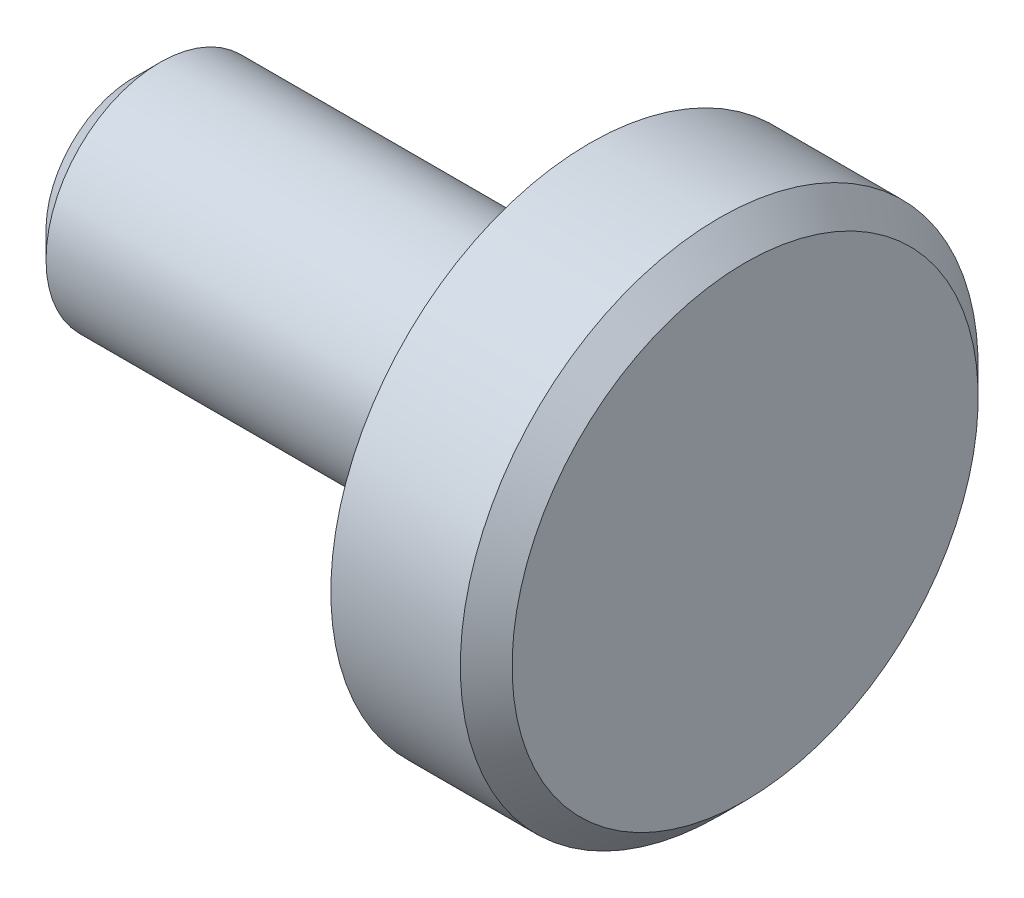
ISO-10303-21;
HEADER;
FILE_DESCRIPTION(('STEP AP214'),'2;1');
FILE_NAME('part.step','',(''),(''),'','','');
FILE_SCHEMA(('AUTOMOTIVE_DESIGN { 1 0 10303 214 1 1 1 1 }'));
ENDSEC;
DATA;
#1=APPLICATION_CONTEXT('core data for automotive mechanical design processes');
#2=APPLICATION_PROTOCOL_DEFINITION('international standard','automotive_design',2000,#1);
#3=PRODUCT_CONTEXT('',#1,'mechanical');
#4=PRODUCT('Part','Part','',(#3));
#5=PRODUCT_RELATED_PRODUCT_CATEGORY('part','',(#4));
#6=PRODUCT_DEFINITION_FORMATION('','',#4);
#7=PRODUCT_DEFINITION_CONTEXT('part definition',#1,'design');
#8=PRODUCT_DEFINITION('design','',#6,#7);
#9=PRODUCT_DEFINITION_SHAPE('','',#8);
#10=(LENGTH_UNIT() NAMED_UNIT(*) SI_UNIT(.MILLI.,.METRE.));
#11=(NAMED_UNIT(*) PLANE_ANGLE_UNIT() SI_UNIT($,.RADIAN.));
#12=(NAMED_UNIT(*) SI_UNIT($,.STERADIAN.) SOLID_ANGLE_UNIT());
#13=UNCERTAINTY_MEASURE_WITH_UNIT(LENGTH_MEASURE(1.E-05),#10,'distance_accuracy_value','');
#14=(GEOMETRIC_REPRESENTATION_CONTEXT(3) GLOBAL_UNCERTAINTY_ASSIGNED_CONTEXT((#13)) GLOBAL_UNIT_ASSIGNED_CONTEXT((#10,
#11,#12)) REPRESENTATION_CONTEXT('',''));
#15=CARTESIAN_POINT('',(0.,0.,0.));
#16=DIRECTION('',(0.,0.,1.));
#17=DIRECTION('',(1.,0.,0.));
#18=AXIS2_PLACEMENT_3D('',#15,#16,#17);
#19=CARTESIAN_POINT('',(0.,6.35,0.));
#20=DIRECTION('',(1.,0.,0.));
#21=DIRECTION('',(0.,1.,0.));
#22=AXIS2_PLACEMENT_3D('',#19,#20,#21);
#23=PLANE('',#22);
#24=CARTESIAN_POINT('',(0.,0.,0.));
#25=DIRECTION('',(1.,0.,0.));
#26=DIRECTION('',(0.,1.,0.));
#27=AXIS2_PLACEMENT_3D('',#24,#25,#26);
#28=CIRCLE('',#27,5.715);
#29=CARTESIAN_POINT('',(0.,5.715,0.));
#30=VERTEX_POINT('',#29);
#31=EDGE_CURVE('E50',#30,#30,#28,.T.);
#32=ORIENTED_EDGE('',*,*,#31,.T.);
#33=EDGE_LOOP('',(#32));
#34=FACE_BOUND('',#33,.T.);
#35=ADVANCED_FACE('F35',(#34),#23,.T.);
#36=CARTESIAN_POINT('',(-14.986,0.,0.));
#37=DIRECTION('',(-1.,0.,0.));
#38=DIRECTION('',(0.,-1.,0.));
#39=AXIS2_PLACEMENT_3D('',#36,#37,#38);
#40=PLANE('',#39);
#41=CARTESIAN_POINT('',(-14.986,0.,0.));
#42=DIRECTION('',(-1.,0.,0.));
#43=DIRECTION('',(0.,-1.,0.));
#44=AXIS2_PLACEMENT_3D('',#41,#42,#43);
#45=CIRCLE('',#44,2.15899999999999);
#46=CARTESIAN_POINT('',(-14.986,-2.15899999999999,0.));
#47=VERTEX_POINT('',#46);
#48=EDGE_CURVE('E10',#47,#47,#45,.T.);
#49=ORIENTED_EDGE('',*,*,#48,.T.);
#50=EDGE_LOOP('',(#49));
#51=FACE_BOUND('',#50,.T.);
#52=ADVANCED_FACE('F76',(#51),#40,.T.);
#53=CARTESIAN_POINT('',(0.,0.,0.));
#54=DIRECTION('',(1.,0.,0.));
#55=DIRECTION('',(0.,1.,0.));
#56=AXIS2_PLACEMENT_3D('',#53,#54,#55);
#57=CYLINDRICAL_SURFACE('',#56,2.794);
#58=CARTESIAN_POINT('',(-14.351,0.,0.));
#59=DIRECTION('',(-1.,0.,0.));
#60=DIRECTION('',(0.,-1.,0.));
#61=AXIS2_PLACEMENT_3D('',#58,#59,#60);
#62=CIRCLE('',#61,2.794);
#63=CARTESIAN_POINT('',(-14.351,-2.794,0.));
#64=VERTEX_POINT('',#63);
#65=EDGE_CURVE('E42',#64,#64,#62,.F.);
#66=ORIENTED_EDGE('',*,*,#65,.T.);
#67=EDGE_LOOP('',(#66));
#68=FACE_BOUND('',#67,.T.);
#69=CARTESIAN_POINT('',(-3.81,0.,0.));
#70=DIRECTION('',(1.,0.,0.));
#71=DIRECTION('',(0.,1.,0.));
#72=AXIS2_PLACEMENT_3D('',#69,#70,#71);
#73=CIRCLE('',#72,2.794);
#74=CARTESIAN_POINT('',(-3.81,2.794,0.));
#75=VERTEX_POINT('',#74);
#76=EDGE_CURVE('E55',#75,#75,#73,.T.);
#77=ORIENTED_EDGE('',*,*,#76,.F.);
#78=EDGE_LOOP('',(#77));
#79=FACE_BOUND('',#78,.T.);
#80=ADVANCED_FACE('F66',(#68,#79),#57,.T.);
#81=CARTESIAN_POINT('',(-3.81,2.794,0.));
#82=DIRECTION('',(-1.,0.,0.));
#83=DIRECTION('',(0.,-1.,0.));
#84=AXIS2_PLACEMENT_3D('',#81,#82,#83);
#85=PLANE('',#84);
#86=ORIENTED_EDGE('',*,*,#76,.T.);
#87=EDGE_LOOP('',(#86));
#88=FACE_BOUND('',#87,.T.);
#89=CARTESIAN_POINT('',(-3.81,0.,0.));
#90=DIRECTION('',(1.,0.,0.));
#91=DIRECTION('',(0.,1.,0.));
#92=AXIS2_PLACEMENT_3D('',#89,#90,#91);
#93=CIRCLE('',#92,6.35);
#94=CARTESIAN_POINT('',(-3.81,6.35,0.));
#95=VERTEX_POINT('',#94);
#96=EDGE_CURVE('E58',#95,#95,#93,.T.);
#97=ORIENTED_EDGE('',*,*,#96,.F.);
#98=EDGE_LOOP('',(#97));
#99=FACE_BOUND('',#98,.T.);
#100=ADVANCED_FACE('F64',(#88,#99),#85,.T.);
#101=CARTESIAN_POINT('',(0.,0.,0.));
#102=DIRECTION('',(1.,0.,0.));
#103=DIRECTION('',(0.,1.,0.));
#104=AXIS2_PLACEMENT_3D('',#101,#102,#103);
#105=CYLINDRICAL_SURFACE('',#104,6.35);
#106=CARTESIAN_POINT('',(-0.635,0.,0.));
#107=DIRECTION('',(1.,0.,0.));
#108=DIRECTION('',(0.,1.,0.));
#109=AXIS2_PLACEMENT_3D('',#106,#107,#108);
#110=CIRCLE('',#109,6.35);
#111=CARTESIAN_POINT('',(-0.635,6.35,0.));
#112=VERTEX_POINT('',#111);
#113=EDGE_CURVE('E46',#112,#112,#110,.F.);
#114=ORIENTED_EDGE('',*,*,#113,.T.);
#115=EDGE_LOOP('',(#114));
#116=FACE_BOUND('',#115,.T.);
#117=ORIENTED_EDGE('',*,*,#96,.T.);
#118=EDGE_LOOP('',(#117));
#119=FACE_BOUND('',#118,.T.);
#120=ADVANCED_FACE('F62',(#116,#119),#105,.T.);
#121=CARTESIAN_POINT('',(0.,0.,0.));
#122=DIRECTION('',(-1.,0.,0.));
#123=DIRECTION('',(0.,-1.,0.));
#124=AXIS2_PLACEMENT_3D('',#121,#122,#123);
#125=CONICAL_SURFACE('',#124,5.715,0.785398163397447);
#126=ORIENTED_EDGE('',*,*,#113,.F.);
#127=EDGE_LOOP('',(#126));
#128=FACE_BOUND('',#127,.T.);
#129=ORIENTED_EDGE('',*,*,#31,.F.);
#130=EDGE_LOOP('',(#129));
#131=FACE_BOUND('',#130,.T.);
#132=ADVANCED_FACE('F73',(#128,#131),#125,.T.);
#133=CARTESIAN_POINT('',(-14.351,0.,0.));
#134=DIRECTION('',(1.,0.,0.));
#135=DIRECTION('',(0.,1.,0.));
#136=AXIS2_PLACEMENT_3D('',#133,#134,#135);
#137=CONICAL_SURFACE('',#136,2.794,0.78539816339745);
#138=ORIENTED_EDGE('',*,*,#48,.F.);
#139=EDGE_LOOP('',(#138));
#140=FACE_BOUND('',#139,.T.);
#141=ORIENTED_EDGE('',*,*,#65,.F.);
#142=EDGE_LOOP('',(#141));
#143=FACE_BOUND('',#142,.T.);
#144=ADVANCED_FACE('F37',(#140,#143),#137,.T.);
#145=CLOSED_SHELL('',(#35,#52,#80,#100,#120,#132,#144));
#146=MANIFOLD_SOLID_BREP('B2',#145);
#147=ADVANCED_BREP_SHAPE_REPRESENTATION('',(#18,#146),#14);
#148=SHAPE_DEFINITION_REPRESENTATION(#9,#147);
ENDSEC;
END-ISO-10303-21;
